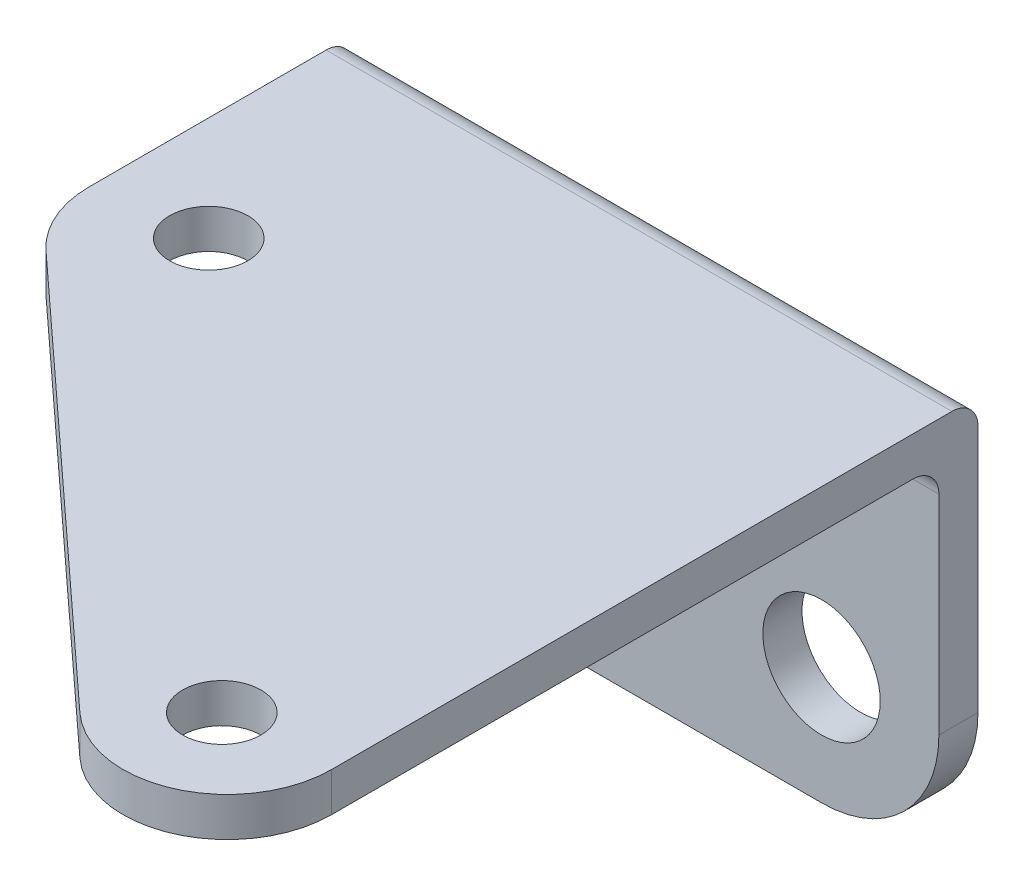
from build123d import *

# Parameters (mm, degrees)
SKETCH1_W           = 48
SKETCH1_H           = 27
SKETCH1_R           = 4.5
BOSS_EXTRUDE1_DEPTH = 3
FILLET1_R           = 9
SKETCH2_R           = 3
BOSS_EXTRUDE2_DEPTH = 3
FILLET2_R           = 8
FILLET3_R           = 8
FILLET4_R           = 2


with BuildPart() as part:
    # Sketch1 → Boss-Extrude1 (new body)
    with BuildSketch(Plane.XY):
        with Locations((-24, -13.5)):
            Rectangle(SKETCH1_W, SKETCH1_H)
        with Locations((-39, -18)):
            Circle(SKETCH1_R, mode=Mode.SUBTRACT)
        with Locations((-9, -18)):
            Circle(SKETCH1_R, mode=Mode.SUBTRACT)
    extrude(amount=BOSS_EXTRUDE1_DEPTH)

    # Fillet1
    fillet1_edges = [part.edges().sort_by_distance(p)[0] for p in [
        (0, -27, 1.5),
        (-48, -27, 1.5),
    ]]
    fillet(fillet1_edges, radius=FILLET1_R)

    # Sketch2 → Boss-Extrude2 (add)
    with BuildSketch(Plane(origin=(0, 0, 0), x_dir=(1, 0, 0), z_dir=(0, 1, 0))):
        Polygon((0, 0), (0, -67.790456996), (-48, -23.691853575), (-48, 0), align=None)
        with Locations(Location((-40, -19, 0), (0, 0, 180))):
            Circle(SKETCH2_R, mode=Mode.SUBTRACT)
        with Locations(Location((-8, -50, 0), (0, 0, 180))):
            Circle(SKETCH2_R, mode=Mode.SUBTRACT)
    extrude(amount=BOSS_EXTRUDE2_DEPTH)

    # Fillet2
    fillet2_edges = [part.edges().sort_by_distance(p)[0] for p in [
        (0, 1.5, 67.790456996),
    ]]
    fillet(fillet2_edges, radius=FILLET2_R)

    # Fillet3
    fillet3_edges = [part.edges().sort_by_distance(p)[0] for p in [
        (-48, 1.5, 23.691853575),
    ]]
    fillet(fillet3_edges, radius=FILLET3_R)

    # Fillet4
    fillet4_edges = [part.edges().sort_by_distance(p)[0] for p in [
        (-24, 3, 0),
        (-24, 0, 3),
    ]]
    fillet(fillet4_edges, radius=FILLET4_R)


solid = part.part
